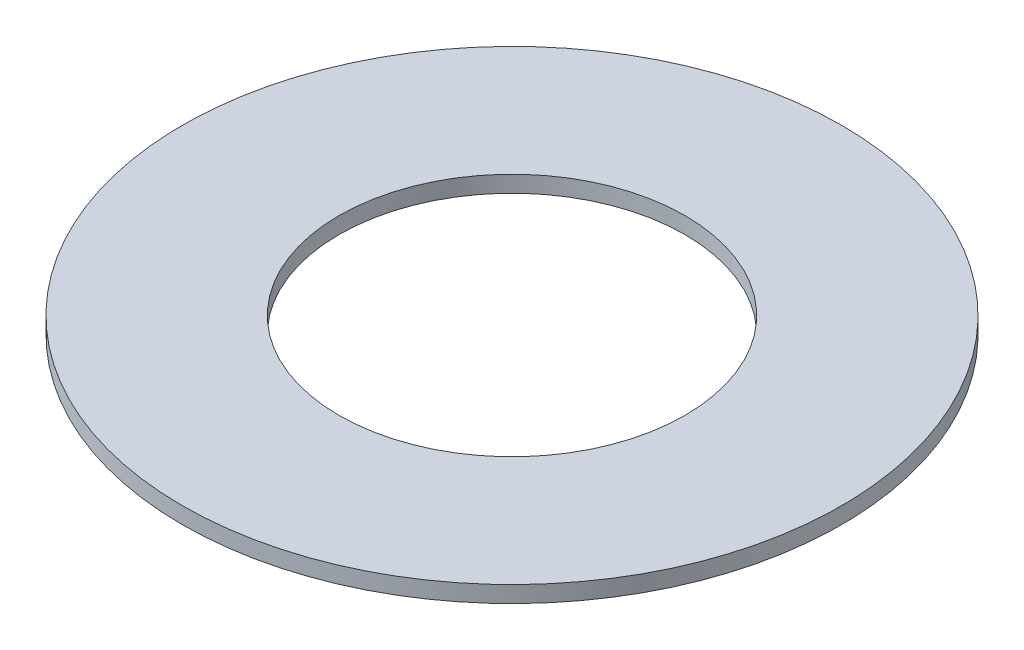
ISO-10303-21;
HEADER;
FILE_DESCRIPTION(('STEP AP214'),'2;1');
FILE_NAME('part.step','',(''),(''),'','','');
FILE_SCHEMA(('AUTOMOTIVE_DESIGN { 1 0 10303 214 1 1 1 1 }'));
ENDSEC;
DATA;
#1=APPLICATION_CONTEXT('core data for automotive mechanical design processes');
#2=APPLICATION_PROTOCOL_DEFINITION('international standard','automotive_design',2000,#1);
#3=PRODUCT_CONTEXT('',#1,'mechanical');
#4=PRODUCT('Part','Part','',(#3));
#5=PRODUCT_RELATED_PRODUCT_CATEGORY('part','',(#4));
#6=PRODUCT_DEFINITION_FORMATION('','',#4);
#7=PRODUCT_DEFINITION_CONTEXT('part definition',#1,'design');
#8=PRODUCT_DEFINITION('design','',#6,#7);
#9=PRODUCT_DEFINITION_SHAPE('','',#8);
#10=(LENGTH_UNIT() NAMED_UNIT(*) SI_UNIT(.MILLI.,.METRE.));
#11=(NAMED_UNIT(*) PLANE_ANGLE_UNIT() SI_UNIT($,.RADIAN.));
#12=(NAMED_UNIT(*) SI_UNIT($,.STERADIAN.) SOLID_ANGLE_UNIT());
#13=UNCERTAINTY_MEASURE_WITH_UNIT(LENGTH_MEASURE(1.E-05),#10,'distance_accuracy_value','');
#14=(GEOMETRIC_REPRESENTATION_CONTEXT(3) GLOBAL_UNCERTAINTY_ASSIGNED_CONTEXT((#13)) GLOBAL_UNIT_ASSIGNED_CONTEXT((#10,
#11,#12)) REPRESENTATION_CONTEXT('',''));
#15=CARTESIAN_POINT('',(0.,0.,0.));
#16=DIRECTION('',(0.,0.,1.));
#17=DIRECTION('',(1.,0.,0.));
#18=AXIS2_PLACEMENT_3D('',#15,#16,#17);
#19=CARTESIAN_POINT('',(0.,0.5,0.));
#20=DIRECTION('',(0.,1.,0.));
#21=DIRECTION('',(0.,0.,1.));
#22=AXIS2_PLACEMENT_3D('',#19,#20,#21);
#23=PLANE('',#22);
#24=CARTESIAN_POINT('',(0.,0.5,0.));
#25=DIRECTION('',(0.,1.,0.));
#26=DIRECTION('',(0.,0.,1.));
#27=AXIS2_PLACEMENT_3D('',#24,#25,#26);
#28=CIRCLE('',#27,10.);
#29=CARTESIAN_POINT('',(0.,0.5,10.));
#30=VERTEX_POINT('',#29);
#31=EDGE_CURVE('E10',#30,#30,#28,.T.);
#32=ORIENTED_EDGE('',*,*,#31,.T.);
#33=EDGE_LOOP('',(#32));
#34=FACE_BOUND('',#33,.T.);
#35=CARTESIAN_POINT('',(0.,0.5,0.));
#36=DIRECTION('',(0.,1.,0.));
#37=DIRECTION('',(0.,0.,1.));
#38=AXIS2_PLACEMENT_3D('',#35,#36,#37);
#39=CIRCLE('',#38,5.25);
#40=CARTESIAN_POINT('',(0.,0.5,5.25));
#41=VERTEX_POINT('',#40);
#42=EDGE_CURVE('E45',#41,#41,#39,.T.);
#43=ORIENTED_EDGE('',*,*,#42,.F.);
#44=EDGE_LOOP('',(#43));
#45=FACE_BOUND('',#44,.T.);
#46=ADVANCED_FACE('F34',(#34,#45),#23,.T.);
#47=CARTESIAN_POINT('',(0.,0.,0.));
#48=DIRECTION('',(0.,1.,0.));
#49=DIRECTION('',(0.,0.,1.));
#50=AXIS2_PLACEMENT_3D('',#47,#48,#49);
#51=PLANE('',#50);
#52=CARTESIAN_POINT('',(0.,0.,0.));
#53=DIRECTION('',(0.,1.,0.));
#54=DIRECTION('',(0.,0.,1.));
#55=AXIS2_PLACEMENT_3D('',#52,#53,#54);
#56=CIRCLE('',#55,10.);
#57=CARTESIAN_POINT('',(0.,0.,10.));
#58=VERTEX_POINT('',#57);
#59=EDGE_CURVE('E38',#58,#58,#56,.T.);
#60=ORIENTED_EDGE('',*,*,#59,.F.);
#61=EDGE_LOOP('',(#60));
#62=FACE_BOUND('',#61,.T.);
#63=CARTESIAN_POINT('',(0.,0.,0.));
#64=DIRECTION('',(0.,1.,0.));
#65=DIRECTION('',(0.,0.,1.));
#66=AXIS2_PLACEMENT_3D('',#63,#64,#65);
#67=CIRCLE('',#66,5.25);
#68=CARTESIAN_POINT('',(0.,0.,5.25));
#69=VERTEX_POINT('',#68);
#70=EDGE_CURVE('E47',#69,#69,#67,.T.);
#71=ORIENTED_EDGE('',*,*,#70,.T.);
#72=EDGE_LOOP('',(#71));
#73=FACE_BOUND('',#72,.T.);
#74=ADVANCED_FACE('F57',(#62,#73),#51,.F.);
#75=CARTESIAN_POINT('',(0.,0.5,0.));
#76=DIRECTION('',(0.,-1.,0.));
#77=DIRECTION('',(0.,0.,-1.));
#78=AXIS2_PLACEMENT_3D('',#75,#76,#77);
#79=CYLINDRICAL_SURFACE('',#78,10.);
#80=ORIENTED_EDGE('',*,*,#31,.F.);
#81=EDGE_LOOP('',(#80));
#82=FACE_BOUND('',#81,.T.);
#83=ORIENTED_EDGE('',*,*,#59,.T.);
#84=EDGE_LOOP('',(#83));
#85=FACE_BOUND('',#84,.T.);
#86=ADVANCED_FACE('F36',(#82,#85),#79,.T.);
#87=CARTESIAN_POINT('',(0.,0.5,0.));
#88=DIRECTION('',(0.,-1.,0.));
#89=DIRECTION('',(0.,0.,-1.));
#90=AXIS2_PLACEMENT_3D('',#87,#88,#89);
#91=CYLINDRICAL_SURFACE('',#90,5.25);
#92=ORIENTED_EDGE('',*,*,#42,.T.);
#93=EDGE_LOOP('',(#92));
#94=FACE_BOUND('',#93,.T.);
#95=ORIENTED_EDGE('',*,*,#70,.F.);
#96=EDGE_LOOP('',(#95));
#97=FACE_BOUND('',#96,.T.);
#98=ADVANCED_FACE('F53',(#94,#97),#91,.F.);
#99=CLOSED_SHELL('',(#46,#74,#86,#98));
#100=MANIFOLD_SOLID_BREP('B2',#99);
#101=ADVANCED_BREP_SHAPE_REPRESENTATION('',(#18,#100),#14);
#102=SHAPE_DEFINITION_REPRESENTATION(#9,#101);
ENDSEC;
END-ISO-10303-21;
